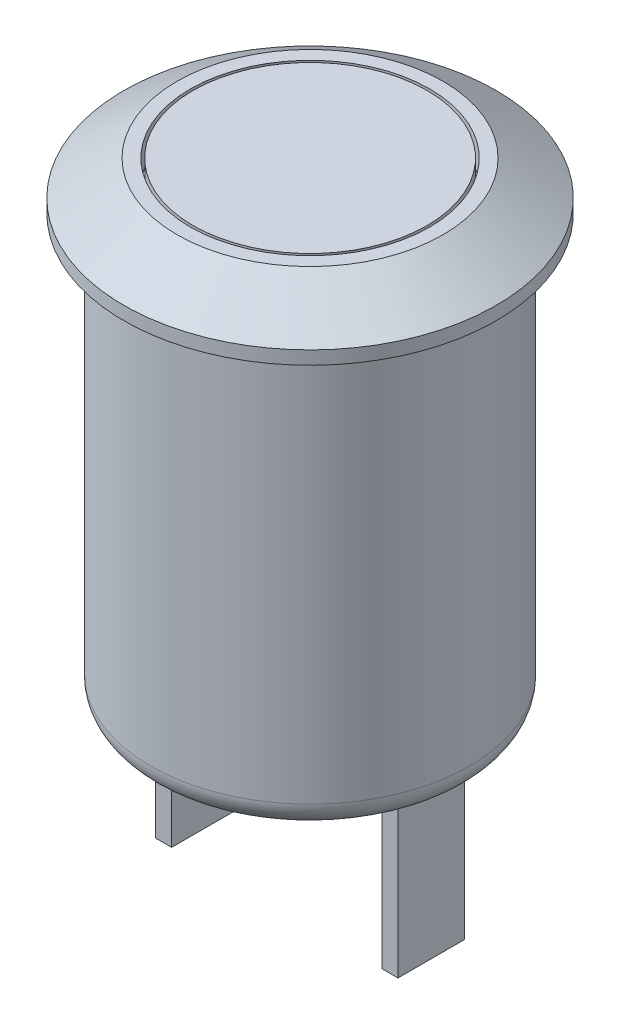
ISO-10303-21;
HEADER;
FILE_DESCRIPTION(('STEP AP214'),'2;1');
FILE_NAME('part.step','',(''),(''),'','','');
FILE_SCHEMA(('AUTOMOTIVE_DESIGN { 1 0 10303 214 1 1 1 1 }'));
ENDSEC;
DATA;
#1=APPLICATION_CONTEXT('core data for automotive mechanical design processes');
#2=APPLICATION_PROTOCOL_DEFINITION('international standard','automotive_design',2000,#1);
#3=PRODUCT_CONTEXT('',#1,'mechanical');
#4=PRODUCT('Part','Part','',(#3));
#5=PRODUCT_RELATED_PRODUCT_CATEGORY('part','',(#4));
#6=PRODUCT_DEFINITION_FORMATION('','',#4);
#7=PRODUCT_DEFINITION_CONTEXT('part definition',#1,'design');
#8=PRODUCT_DEFINITION('design','',#6,#7);
#9=PRODUCT_DEFINITION_SHAPE('','',#8);
#10=(LENGTH_UNIT() NAMED_UNIT(*) SI_UNIT(.MILLI.,.METRE.));
#11=(NAMED_UNIT(*) PLANE_ANGLE_UNIT() SI_UNIT($,.RADIAN.));
#12=(NAMED_UNIT(*) SI_UNIT($,.STERADIAN.) SOLID_ANGLE_UNIT());
#13=UNCERTAINTY_MEASURE_WITH_UNIT(LENGTH_MEASURE(1.E-05),#10,'distance_accuracy_value','');
#14=(GEOMETRIC_REPRESENTATION_CONTEXT(3) GLOBAL_UNCERTAINTY_ASSIGNED_CONTEXT((#13)) GLOBAL_UNIT_ASSIGNED_CONTEXT((#10,
#11,#12)) REPRESENTATION_CONTEXT('',''));
#15=CARTESIAN_POINT('',(0.,0.,0.));
#16=DIRECTION('',(0.,0.,1.));
#17=DIRECTION('',(1.,0.,0.));
#18=AXIS2_PLACEMENT_3D('',#15,#16,#17);
#19=CARTESIAN_POINT('',(6.,-16.,0.));
#20=DIRECTION('',(0.,-1.,0.));
#21=DIRECTION('',(0.,0.,-1.));
#22=AXIS2_PLACEMENT_3D('',#19,#20,#21);
#23=PLANE('',#22);
#24=CARTESIAN_POINT('',(0.,-16.,0.));
#25=DIRECTION('',(0.,-1.,0.));
#26=DIRECTION('',(0.,0.,-1.));
#27=AXIS2_PLACEMENT_3D('',#24,#25,#26);
#28=CIRCLE('',#27,5.);
#29=CARTESIAN_POINT('',(0.,-16.,-5.));
#30=VERTEX_POINT('',#29);
#31=EDGE_CURVE('E41',#30,#30,#28,.T.);
#32=ORIENTED_EDGE('',*,*,#31,.T.);
#33=EDGE_LOOP('',(#32));
#34=FACE_BOUND('',#33,.T.);
#35=DIRECTION('',(0.,0.,-1.));
#36=VECTOR('',#35,1.);
#37=CARTESIAN_POINT('',(-4.55434782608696,-16.,1.25));
#38=LINE('',#37,#36);
#39=CARTESIAN_POINT('',(-4.55434782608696,-16.,1.25));
#40=VERTEX_POINT('',#39);
#41=CARTESIAN_POINT('',(-4.55434782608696,-16.,-1.25));
#42=VERTEX_POINT('',#41);
#43=EDGE_CURVE('E127',#40,#42,#38,.T.);
#44=ORIENTED_EDGE('',*,*,#43,.F.);
#45=DIRECTION('',(-1.,0.,0.));
#46=VECTOR('',#45,1.);
#47=CARTESIAN_POINT('',(-4.55434782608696,-16.,1.25));
#48=LINE('',#47,#46);
#49=CARTESIAN_POINT('',(-3.95434782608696,-16.,1.25));
#50=VERTEX_POINT('',#49);
#51=EDGE_CURVE('E124',#50,#40,#48,.T.);
#52=ORIENTED_EDGE('',*,*,#51,.F.);
#53=DIRECTION('',(0.,0.,1.));
#54=VECTOR('',#53,1.);
#55=CARTESIAN_POINT('',(-3.95434782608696,-16.,1.25));
#56=LINE('',#55,#54);
#57=CARTESIAN_POINT('',(-3.95434782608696,-16.,-1.25));
#58=VERTEX_POINT('',#57);
#59=EDGE_CURVE('E136',#58,#50,#56,.T.);
#60=ORIENTED_EDGE('',*,*,#59,.F.);
#61=DIRECTION('',(1.,0.,0.));
#62=VECTOR('',#61,1.);
#63=CARTESIAN_POINT('',(-4.55434782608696,-16.,-1.25));
#64=LINE('',#63,#62);
#65=EDGE_CURVE('E144',#42,#58,#64,.T.);
#66=ORIENTED_EDGE('',*,*,#65,.F.);
#67=EDGE_LOOP('',(#44,#52,#60,#66));
#68=FACE_BOUND('',#67,.T.);
#69=DIRECTION('',(0.,0.,-1.));
#70=VECTOR('',#69,1.);
#71=CARTESIAN_POINT('',(3.95434782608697,-16.,1.25));
#72=LINE('',#71,#70);
#73=CARTESIAN_POINT('',(3.95434782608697,-16.,1.25));
#74=VERTEX_POINT('',#73);
#75=CARTESIAN_POINT('',(3.95434782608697,-16.,-1.25));
#76=VERTEX_POINT('',#75);
#77=EDGE_CURVE('E388',#74,#76,#72,.T.);
#78=ORIENTED_EDGE('',*,*,#77,.F.);
#79=DIRECTION('',(-1.,0.,0.));
#80=VECTOR('',#79,1.);
#81=CARTESIAN_POINT('',(3.95434782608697,-16.,1.25));
#82=LINE('',#81,#80);
#83=CARTESIAN_POINT('',(4.55434782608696,-16.,1.25));
#84=VERTEX_POINT('',#83);
#85=EDGE_CURVE('E122',#84,#74,#82,.T.);
#86=ORIENTED_EDGE('',*,*,#85,.F.);
#87=DIRECTION('',(0.,0.,1.));
#88=VECTOR('',#87,1.);
#89=CARTESIAN_POINT('',(4.55434782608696,-16.,1.25));
#90=LINE('',#89,#88);
#91=CARTESIAN_POINT('',(4.55434782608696,-16.,-1.25));
#92=VERTEX_POINT('',#91);
#93=EDGE_CURVE('E118',#92,#84,#90,.T.);
#94=ORIENTED_EDGE('',*,*,#93,.F.);
#95=DIRECTION('',(1.,0.,0.));
#96=VECTOR('',#95,1.);
#97=CARTESIAN_POINT('',(3.95434782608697,-16.,-1.25));
#98=LINE('',#97,#96);
#99=EDGE_CURVE('E385',#76,#92,#98,.T.);
#100=ORIENTED_EDGE('',*,*,#99,.F.);
#101=EDGE_LOOP('',(#78,#86,#94,#100));
#102=FACE_BOUND('',#101,.T.);
#103=ADVANCED_FACE('F33',(#34,#68,#102),#23,.T.);
#104=CARTESIAN_POINT('',(0.,1.8,0.));
#105=DIRECTION('',(0.,1.,0.));
#106=DIRECTION('',(0.,0.,1.));
#107=AXIS2_PLACEMENT_3D('',#104,#105,#106);
#108=PLANE('',#107);
#109=CARTESIAN_POINT('',(0.,1.8,0.));
#110=DIRECTION('',(0.,-1.,0.));
#111=DIRECTION('',(0.,0.,-1.));
#112=AXIS2_PLACEMENT_3D('',#109,#110,#111);
#113=CIRCLE('',#112,4.4);
#114=CARTESIAN_POINT('',(0.,1.8,-4.4));
#115=VERTEX_POINT('',#114);
#116=EDGE_CURVE('E176',#115,#115,#113,.T.);
#117=ORIENTED_EDGE('',*,*,#116,.F.);
#118=EDGE_LOOP('',(#117));
#119=FACE_BOUND('',#118,.T.);
#120=ADVANCED_FACE('F199',(#119),#108,.T.);
#121=CARTESIAN_POINT('',(0.,0.,0.));
#122=DIRECTION('',(0.,-1.,0.));
#123=DIRECTION('',(0.,0.,-1.));
#124=AXIS2_PLACEMENT_3D('',#121,#122,#123);
#125=CYLINDRICAL_SURFACE('',#124,4.4);
#126=ORIENTED_EDGE('',*,*,#116,.T.);
#127=EDGE_LOOP('',(#126));
#128=FACE_BOUND('',#127,.T.);
#129=CARTESIAN_POINT('',(0.,0.800000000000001,0.));
#130=DIRECTION('',(0.,-1.,0.));
#131=DIRECTION('',(0.,0.,-1.));
#132=AXIS2_PLACEMENT_3D('',#129,#130,#131);
#133=CIRCLE('',#132,4.4);
#134=CARTESIAN_POINT('',(0.,0.800000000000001,-4.4));
#135=VERTEX_POINT('',#134);
#136=EDGE_CURVE('E173',#135,#135,#133,.T.);
#137=ORIENTED_EDGE('',*,*,#136,.F.);
#138=EDGE_LOOP('',(#137));
#139=FACE_BOUND('',#138,.T.);
#140=ADVANCED_FACE('F203',(#128,#139),#125,.T.);
#141=CARTESIAN_POINT('',(4.4,0.800000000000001,0.));
#142=DIRECTION('',(0.,1.,0.));
#143=DIRECTION('',(0.,0.,1.));
#144=AXIS2_PLACEMENT_3D('',#141,#142,#143);
#145=PLANE('',#144);
#146=ORIENTED_EDGE('',*,*,#136,.T.);
#147=EDGE_LOOP('',(#146));
#148=FACE_BOUND('',#147,.T.);
#149=CARTESIAN_POINT('',(0.,0.800000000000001,0.));
#150=DIRECTION('',(0.,-1.,0.));
#151=DIRECTION('',(0.,0.,-1.));
#152=AXIS2_PLACEMENT_3D('',#149,#150,#151);
#153=CIRCLE('',#152,4.5);
#154=CARTESIAN_POINT('',(0.,0.800000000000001,-4.5));
#155=VERTEX_POINT('',#154);
#156=EDGE_CURVE('E170',#155,#155,#153,.T.);
#157=ORIENTED_EDGE('',*,*,#156,.F.);
#158=EDGE_LOOP('',(#157));
#159=FACE_BOUND('',#158,.T.);
#160=ADVANCED_FACE('F209',(#148,#159),#145,.T.);
#161=CARTESIAN_POINT('',(0.,0.,0.));
#162=DIRECTION('',(0.,-1.,0.));
#163=DIRECTION('',(0.,0.,-1.));
#164=AXIS2_PLACEMENT_3D('',#161,#162,#163);
#165=CYLINDRICAL_SURFACE('',#164,4.5);
#166=ORIENTED_EDGE('',*,*,#156,.T.);
#167=EDGE_LOOP('',(#166));
#168=FACE_BOUND('',#167,.T.);
#169=CARTESIAN_POINT('',(0.,1.8,0.));
#170=DIRECTION('',(0.,-1.,0.));
#171=DIRECTION('',(0.,0.,-1.));
#172=AXIS2_PLACEMENT_3D('',#169,#170,#171);
#173=CIRCLE('',#172,4.5);
#174=CARTESIAN_POINT('',(0.,1.8,-4.5));
#175=VERTEX_POINT('',#174);
#176=EDGE_CURVE('E167',#175,#175,#173,.T.);
#177=ORIENTED_EDGE('',*,*,#176,.F.);
#178=EDGE_LOOP('',(#177));
#179=FACE_BOUND('',#178,.T.);
#180=ADVANCED_FACE('F213',(#168,#179),#165,.F.);
#181=CARTESIAN_POINT('',(4.5,1.8,0.));
#182=DIRECTION('',(0.,1.,0.));
#183=DIRECTION('',(0.,0.,1.));
#184=AXIS2_PLACEMENT_3D('',#181,#182,#183);
#185=PLANE('',#184);
#186=ORIENTED_EDGE('',*,*,#176,.T.);
#187=EDGE_LOOP('',(#186));
#188=FACE_BOUND('',#187,.T.);
#189=CARTESIAN_POINT('',(0.,1.8,0.));
#190=DIRECTION('',(0.,-1.,0.));
#191=DIRECTION('',(0.,0.,-1.));
#192=AXIS2_PLACEMENT_3D('',#189,#190,#191);
#193=CIRCLE('',#192,5.);
#194=CARTESIAN_POINT('',(0.,1.8,-5.));
#195=VERTEX_POINT('',#194);
#196=EDGE_CURVE('E164',#195,#195,#193,.T.);
#197=ORIENTED_EDGE('',*,*,#196,.F.);
#198=EDGE_LOOP('',(#197));
#199=FACE_BOUND('',#198,.T.);
#200=ADVANCED_FACE('F217',(#188,#199),#185,.T.);
#201=CARTESIAN_POINT('',(0.,0.500000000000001,0.));
#202=DIRECTION('',(0.,-1.,0.));
#203=DIRECTION('',(0.,0.,-1.));
#204=AXIS2_PLACEMENT_3D('',#201,#202,#203);
#205=CONICAL_SURFACE('',#204,7.,0.994421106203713);
#206=ORIENTED_EDGE('',*,*,#196,.T.);
#207=EDGE_LOOP('',(#206));
#208=FACE_BOUND('',#207,.T.);
#209=CARTESIAN_POINT('',(0.,0.500000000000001,0.));
#210=DIRECTION('',(0.,-1.,0.));
#211=DIRECTION('',(0.,0.,-1.));
#212=AXIS2_PLACEMENT_3D('',#209,#210,#211);
#213=CIRCLE('',#212,7.);
#214=CARTESIAN_POINT('',(0.,0.500000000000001,-7.));
#215=VERTEX_POINT('',#214);
#216=EDGE_CURVE('E161',#215,#215,#213,.T.);
#217=ORIENTED_EDGE('',*,*,#216,.F.);
#218=EDGE_LOOP('',(#217));
#219=FACE_BOUND('',#218,.T.);
#220=ADVANCED_FACE('F221',(#208,#219),#205,.T.);
#221=CARTESIAN_POINT('',(0.,0.,0.));
#222=DIRECTION('',(0.,-1.,0.));
#223=DIRECTION('',(0.,0.,-1.));
#224=AXIS2_PLACEMENT_3D('',#221,#222,#223);
#225=CYLINDRICAL_SURFACE('',#224,7.);
#226=ORIENTED_EDGE('',*,*,#216,.T.);
#227=EDGE_LOOP('',(#226));
#228=FACE_BOUND('',#227,.T.);
#229=CARTESIAN_POINT('',(0.,0.,0.));
#230=DIRECTION('',(0.,-1.,0.));
#231=DIRECTION('',(0.,0.,-1.));
#232=AXIS2_PLACEMENT_3D('',#229,#230,#231);
#233=CIRCLE('',#232,7.);
#234=CARTESIAN_POINT('',(0.,0.,-7.));
#235=VERTEX_POINT('',#234);
#236=EDGE_CURVE('E158',#235,#235,#233,.T.);
#237=ORIENTED_EDGE('',*,*,#236,.F.);
#238=EDGE_LOOP('',(#237));
#239=FACE_BOUND('',#238,.T.);
#240=ADVANCED_FACE('F225',(#228,#239),#225,.T.);
#241=CARTESIAN_POINT('',(7.,0.,0.));
#242=DIRECTION('',(0.,-1.,0.));
#243=DIRECTION('',(0.,0.,-1.));
#244=AXIS2_PLACEMENT_3D('',#241,#242,#243);
#245=PLANE('',#244);
#246=ORIENTED_EDGE('',*,*,#236,.T.);
#247=EDGE_LOOP('',(#246));
#248=FACE_BOUND('',#247,.T.);
#249=CARTESIAN_POINT('',(0.,0.,0.));
#250=DIRECTION('',(0.,-1.,0.));
#251=DIRECTION('',(0.,0.,-1.));
#252=AXIS2_PLACEMENT_3D('',#249,#250,#251);
#253=CIRCLE('',#252,6.);
#254=CARTESIAN_POINT('',(0.,0.,-6.));
#255=VERTEX_POINT('',#254);
#256=EDGE_CURVE('E155',#255,#255,#253,.T.);
#257=ORIENTED_EDGE('',*,*,#256,.F.);
#258=EDGE_LOOP('',(#257));
#259=FACE_BOUND('',#258,.T.);
#260=ADVANCED_FACE('F194',(#248,#259),#245,.T.);
#261=CARTESIAN_POINT('',(0.,0.,0.));
#262=DIRECTION('',(0.,-1.,0.));
#263=DIRECTION('',(0.,0.,-1.));
#264=AXIS2_PLACEMENT_3D('',#261,#262,#263);
#265=CYLINDRICAL_SURFACE('',#264,6.);
#266=CARTESIAN_POINT('',(0.,-15.,0.));
#267=DIRECTION('',(0.,-1.,0.));
#268=DIRECTION('',(0.,0.,-1.));
#269=AXIS2_PLACEMENT_3D('',#266,#267,#268);
#270=CIRCLE('',#269,6.);
#271=CARTESIAN_POINT('',(0.,-15.,-6.));
#272=VERTEX_POINT('',#271);
#273=EDGE_CURVE('E11',#272,#272,#270,.F.);
#274=ORIENTED_EDGE('',*,*,#273,.T.);
#275=EDGE_LOOP('',(#274));
#276=FACE_BOUND('',#275,.T.);
#277=ORIENTED_EDGE('',*,*,#256,.T.);
#278=EDGE_LOOP('',(#277));
#279=FACE_BOUND('',#278,.T.);
#280=ADVANCED_FACE('F185',(#276,#279),#265,.T.);
#281=CARTESIAN_POINT('',(0.,-15.,0.));
#282=DIRECTION('',(0.,-1.,0.));
#283=DIRECTION('',(0.,0.,-1.));
#284=AXIS2_PLACEMENT_3D('',#281,#282,#283);
#285=TOROIDAL_SURFACE('',#284,5.,1.);
#286=ORIENTED_EDGE('',*,*,#273,.F.);
#287=EDGE_LOOP('',(#286));
#288=FACE_BOUND('',#287,.T.);
#289=ORIENTED_EDGE('',*,*,#31,.F.);
#290=EDGE_LOOP('',(#289));
#291=FACE_BOUND('',#290,.T.);
#292=ADVANCED_FACE('F35',(#288,#291),#285,.T.);
#293=CARTESIAN_POINT('',(-4.55434782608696,-22.,1.25));
#294=DIRECTION('',(0.,0.,-1.));
#295=DIRECTION('',(-1.,0.,0.));
#296=AXIS2_PLACEMENT_3D('',#293,#294,#295);
#297=PLANE('',#296);
#298=ORIENTED_EDGE('',*,*,#51,.T.);
#299=DIRECTION('',(0.,1.,0.));
#300=VECTOR('',#299,1.);
#301=CARTESIAN_POINT('',(-4.55434782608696,-22.,1.25));
#302=LINE('',#301,#300);
#303=CARTESIAN_POINT('',(-4.55434782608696,-22.,1.25));
#304=VERTEX_POINT('',#303);
#305=EDGE_CURVE('E153',#304,#40,#302,.T.);
#306=ORIENTED_EDGE('',*,*,#305,.F.);
#307=DIRECTION('',(-1.,0.,0.));
#308=VECTOR('',#307,1.);
#309=CARTESIAN_POINT('',(-4.55434782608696,-22.,1.25));
#310=LINE('',#309,#308);
#311=CARTESIAN_POINT('',(-3.95434782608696,-22.,1.25));
#312=VERTEX_POINT('',#311);
#313=EDGE_CURVE('E132',#312,#304,#310,.T.);
#314=ORIENTED_EDGE('',*,*,#313,.F.);
#315=DIRECTION('',(0.,1.,0.));
#316=VECTOR('',#315,1.);
#317=CARTESIAN_POINT('',(-3.95434782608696,-22.,1.25));
#318=LINE('',#317,#316);
#319=EDGE_CURVE('E141',#312,#50,#318,.T.);
#320=ORIENTED_EDGE('',*,*,#319,.T.);
#321=EDGE_LOOP('',(#298,#306,#314,#320));
#322=FACE_BOUND('',#321,.T.);
#323=ADVANCED_FACE('F184',(#322),#297,.F.);
#324=CARTESIAN_POINT('',(-4.55434782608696,-22.,1.25));
#325=DIRECTION('',(1.,0.,0.));
#326=DIRECTION('',(0.,0.,-1.));
#327=AXIS2_PLACEMENT_3D('',#324,#325,#326);
#328=PLANE('',#327);
#329=ORIENTED_EDGE('',*,*,#43,.T.);
#330=DIRECTION('',(0.,1.,0.));
#331=VECTOR('',#330,1.);
#332=CARTESIAN_POINT('',(-4.55434782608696,-22.,-1.25));
#333=LINE('',#332,#331);
#334=CARTESIAN_POINT('',(-4.55434782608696,-22.,-1.25));
#335=VERTEX_POINT('',#334);
#336=EDGE_CURVE('E150',#335,#42,#333,.T.);
#337=ORIENTED_EDGE('',*,*,#336,.F.);
#338=DIRECTION('',(0.,0.,-1.));
#339=VECTOR('',#338,1.);
#340=CARTESIAN_POINT('',(-4.55434782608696,-22.,1.25));
#341=LINE('',#340,#339);
#342=EDGE_CURVE('E135',#304,#335,#341,.T.);
#343=ORIENTED_EDGE('',*,*,#342,.F.);
#344=ORIENTED_EDGE('',*,*,#305,.T.);
#345=EDGE_LOOP('',(#329,#337,#343,#344));
#346=FACE_BOUND('',#345,.T.);
#347=ADVANCED_FACE('F191',(#346),#328,.F.);
#348=CARTESIAN_POINT('',(-4.55434782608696,-22.,-1.25));
#349=DIRECTION('',(0.,0.,1.));
#350=DIRECTION('',(1.,0.,0.));
#351=AXIS2_PLACEMENT_3D('',#348,#349,#350);
#352=PLANE('',#351);
#353=ORIENTED_EDGE('',*,*,#65,.T.);
#354=DIRECTION('',(0.,1.,0.));
#355=VECTOR('',#354,1.);
#356=CARTESIAN_POINT('',(-3.95434782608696,-22.,-1.25));
#357=LINE('',#356,#355);
#358=CARTESIAN_POINT('',(-3.95434782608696,-22.,-1.25));
#359=VERTEX_POINT('',#358);
#360=EDGE_CURVE('E56',#359,#58,#357,.T.);
#361=ORIENTED_EDGE('',*,*,#360,.F.);
#362=DIRECTION('',(1.,0.,0.));
#363=VECTOR('',#362,1.);
#364=CARTESIAN_POINT('',(-4.55434782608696,-22.,-1.25));
#365=LINE('',#364,#363);
#366=EDGE_CURVE('E138',#335,#359,#365,.T.);
#367=ORIENTED_EDGE('',*,*,#366,.F.);
#368=ORIENTED_EDGE('',*,*,#336,.T.);
#369=EDGE_LOOP('',(#353,#361,#367,#368));
#370=FACE_BOUND('',#369,.T.);
#371=ADVANCED_FACE('F235',(#370),#352,.F.);
#372=CARTESIAN_POINT('',(-3.95434782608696,-22.,1.25));
#373=DIRECTION('',(-1.,0.,0.));
#374=DIRECTION('',(0.,0.,1.));
#375=AXIS2_PLACEMENT_3D('',#372,#373,#374);
#376=PLANE('',#375);
#377=ORIENTED_EDGE('',*,*,#59,.T.);
#378=ORIENTED_EDGE('',*,*,#319,.F.);
#379=DIRECTION('',(0.,0.,1.));
#380=VECTOR('',#379,1.);
#381=CARTESIAN_POINT('',(-3.95434782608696,-22.,1.25));
#382=LINE('',#381,#380);
#383=EDGE_CURVE('E140',#359,#312,#382,.T.);
#384=ORIENTED_EDGE('',*,*,#383,.F.);
#385=ORIENTED_EDGE('',*,*,#360,.T.);
#386=EDGE_LOOP('',(#377,#378,#384,#385));
#387=FACE_BOUND('',#386,.T.);
#388=ADVANCED_FACE('F239',(#387),#376,.F.);
#389=CARTESIAN_POINT('',(0.,-22.,0.));
#390=DIRECTION('',(0.,1.,0.));
#391=DIRECTION('',(0.,0.,1.));
#392=AXIS2_PLACEMENT_3D('',#389,#390,#391);
#393=PLANE('',#392);
#394=ORIENTED_EDGE('',*,*,#313,.T.);
#395=ORIENTED_EDGE('',*,*,#342,.T.);
#396=ORIENTED_EDGE('',*,*,#366,.T.);
#397=ORIENTED_EDGE('',*,*,#383,.T.);
#398=EDGE_LOOP('',(#394,#395,#396,#397));
#399=FACE_BOUND('',#398,.T.);
#400=ADVANCED_FACE('F243',(#399),#393,.F.);
#401=CARTESIAN_POINT('',(3.95434782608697,-22.,1.25));
#402=DIRECTION('',(0.,0.,-1.));
#403=DIRECTION('',(-1.,0.,0.));
#404=AXIS2_PLACEMENT_3D('',#401,#402,#403);
#405=PLANE('',#404);
#406=ORIENTED_EDGE('',*,*,#85,.T.);
#407=DIRECTION('',(0.,1.,0.));
#408=VECTOR('',#407,1.);
#409=CARTESIAN_POINT('',(3.95434782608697,-22.,1.25));
#410=LINE('',#409,#408);
#411=CARTESIAN_POINT('',(3.95434782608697,-22.,1.25));
#412=VERTEX_POINT('',#411);
#413=EDGE_CURVE('E103',#412,#74,#410,.T.);
#414=ORIENTED_EDGE('',*,*,#413,.F.);
#415=DIRECTION('',(-1.,0.,0.));
#416=VECTOR('',#415,1.);
#417=CARTESIAN_POINT('',(3.95434782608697,-22.,1.25));
#418=LINE('',#417,#416);
#419=CARTESIAN_POINT('',(4.55434782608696,-22.,1.25));
#420=VERTEX_POINT('',#419);
#421=EDGE_CURVE('E110',#420,#412,#418,.T.);
#422=ORIENTED_EDGE('',*,*,#421,.F.);
#423=DIRECTION('',(0.,1.,0.));
#424=VECTOR('',#423,1.);
#425=CARTESIAN_POINT('',(4.55434782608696,-22.,1.25));
#426=LINE('',#425,#424);
#427=EDGE_CURVE('E382',#420,#84,#426,.T.);
#428=ORIENTED_EDGE('',*,*,#427,.T.);
#429=EDGE_LOOP('',(#406,#414,#422,#428));
#430=FACE_BOUND('',#429,.T.);
#431=ADVANCED_FACE('F120',(#430),#405,.F.);
#432=CARTESIAN_POINT('',(3.95434782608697,-22.,1.25));
#433=DIRECTION('',(1.,0.,0.));
#434=DIRECTION('',(0.,0.,-1.));
#435=AXIS2_PLACEMENT_3D('',#432,#433,#434);
#436=PLANE('',#435);
#437=ORIENTED_EDGE('',*,*,#77,.T.);
#438=DIRECTION('',(0.,1.,0.));
#439=VECTOR('',#438,1.);
#440=CARTESIAN_POINT('',(3.95434782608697,-22.,-1.25));
#441=LINE('',#440,#439);
#442=CARTESIAN_POINT('',(3.95434782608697,-22.,-1.25));
#443=VERTEX_POINT('',#442);
#444=EDGE_CURVE('E106',#443,#76,#441,.T.);
#445=ORIENTED_EDGE('',*,*,#444,.F.);
#446=DIRECTION('',(0.,0.,-1.));
#447=VECTOR('',#446,1.);
#448=CARTESIAN_POINT('',(3.95434782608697,-22.,1.25));
#449=LINE('',#448,#447);
#450=EDGE_CURVE('E99',#412,#443,#449,.T.);
#451=ORIENTED_EDGE('',*,*,#450,.F.);
#452=ORIENTED_EDGE('',*,*,#413,.T.);
#453=EDGE_LOOP('',(#437,#445,#451,#452));
#454=FACE_BOUND('',#453,.T.);
#455=ADVANCED_FACE('F101',(#454),#436,.F.);
#456=CARTESIAN_POINT('',(3.95434782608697,-22.,-1.25));
#457=DIRECTION('',(0.,0.,1.));
#458=DIRECTION('',(1.,0.,0.));
#459=AXIS2_PLACEMENT_3D('',#456,#457,#458);
#460=PLANE('',#459);
#461=ORIENTED_EDGE('',*,*,#99,.T.);
#462=DIRECTION('',(0.,1.,0.));
#463=VECTOR('',#462,1.);
#464=CARTESIAN_POINT('',(4.55434782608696,-22.,-1.25));
#465=LINE('',#464,#463);
#466=CARTESIAN_POINT('',(4.55434782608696,-22.,-1.25));
#467=VERTEX_POINT('',#466);
#468=EDGE_CURVE('E48',#467,#92,#465,.T.);
#469=ORIENTED_EDGE('',*,*,#468,.F.);
#470=DIRECTION('',(1.,0.,0.));
#471=VECTOR('',#470,1.);
#472=CARTESIAN_POINT('',(3.95434782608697,-22.,-1.25));
#473=LINE('',#472,#471);
#474=EDGE_CURVE('E109',#443,#467,#473,.T.);
#475=ORIENTED_EDGE('',*,*,#474,.F.);
#476=ORIENTED_EDGE('',*,*,#444,.T.);
#477=EDGE_LOOP('',(#461,#469,#475,#476));
#478=FACE_BOUND('',#477,.T.);
#479=ADVANCED_FACE('F251',(#478),#460,.F.);
#480=CARTESIAN_POINT('',(4.55434782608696,-22.,1.25));
#481=DIRECTION('',(-1.,0.,0.));
#482=DIRECTION('',(0.,0.,1.));
#483=AXIS2_PLACEMENT_3D('',#480,#481,#482);
#484=PLANE('',#483);
#485=ORIENTED_EDGE('',*,*,#93,.T.);
#486=ORIENTED_EDGE('',*,*,#427,.F.);
#487=DIRECTION('',(0.,0.,1.));
#488=VECTOR('',#487,1.);
#489=CARTESIAN_POINT('',(4.55434782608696,-22.,1.25));
#490=LINE('',#489,#488);
#491=EDGE_CURVE('E114',#467,#420,#490,.T.);
#492=ORIENTED_EDGE('',*,*,#491,.F.);
#493=ORIENTED_EDGE('',*,*,#468,.T.);
#494=EDGE_LOOP('',(#485,#486,#492,#493));
#495=FACE_BOUND('',#494,.T.);
#496=ADVANCED_FACE('F254',(#495),#484,.F.);
#497=CARTESIAN_POINT('',(0.,-22.,0.));
#498=DIRECTION('',(0.,1.,0.));
#499=DIRECTION('',(0.,0.,1.));
#500=AXIS2_PLACEMENT_3D('',#497,#498,#499);
#501=PLANE('',#500);
#502=ORIENTED_EDGE('',*,*,#421,.T.);
#503=ORIENTED_EDGE('',*,*,#450,.T.);
#504=ORIENTED_EDGE('',*,*,#474,.T.);
#505=ORIENTED_EDGE('',*,*,#491,.T.);
#506=EDGE_LOOP('',(#502,#503,#504,#505));
#507=FACE_BOUND('',#506,.T.);
#508=ADVANCED_FACE('F113',(#507),#501,.F.);
#509=CLOSED_SHELL('',(#103,#120,#140,#160,#180,#200,#220,#240,#260,#280,#292,#323,#347,#371,
#388,#400,#431,#455,#479,#496,#508));
#510=MANIFOLD_SOLID_BREP('B2',#509);
#511=ADVANCED_BREP_SHAPE_REPRESENTATION('',(#18,#510),#14);
#512=SHAPE_DEFINITION_REPRESENTATION(#9,#511);
ENDSEC;
END-ISO-10303-21;
